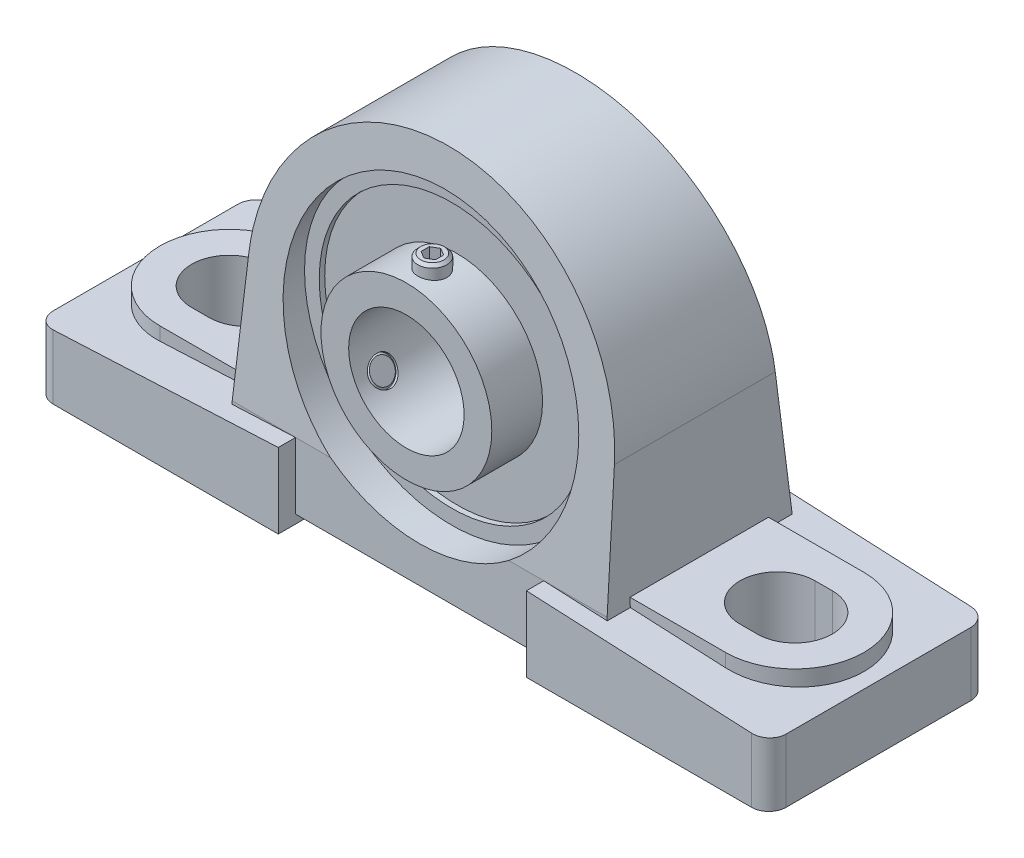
from build123d import *

# Parameters (mm, degrees)
EXTRUSION1_DEPTH             = 16
EXTRUSION1_DEPTH_BACK        = 16
EXTRUSION2_DEPTH             = 14
EXTRUSION3_DEPTH             = 14
ENL_V_MAT_EXTRU_1_DEPTH      = 127
EXTRUSION4_DEPTH             = 19
EXTRUSION4_DEPTH_BACK        = 19
EXTRUSION5_DEPTH             = 19
EXTRUSION5_DEPTH_BACK        = 19
ENL_V_MAT_EXTRU_2_DEPTH      = 15.4
ENL_V_MAT_EXTRU_2_DEPTH_BACK = 15.4
ENL_V_MAT_EXTRU_3_DEPTH      = 15.4
ENL_V_MAT_EXTRU_3_DEPTH_BACK = 15.4
ESQUISSE10_W                 = 31
ESQUISSE10_H                 = 14.8
ESQUISSE11_W                 = 33.54
ESQUISSE11_H                 = 10
ENL_V_MAT_EXTRU_4_DEPTH      = 14
ENL_V_MAT_EXTRU_4_DEPTH_BACK = 14
ESQUISSE12_W                 = 254
ESQUISSE12_H                 = 76
ESQUISSE13_W                 = 2.375
ESQUISSE13_H                 = 15
ENL_V_MAT_EXTRU_5_DEPTH      = 3.3
ENL_V_MAT_EXTRU_6_DEPTH      = 3.3


with BuildPart() as part:
    # Esquisse1 → Extrusion1 (new, two sides: drawn at the far end of the back side and taken through both)
    with BuildSketch(Plane.XY.offset(-EXTRUSION1_DEPTH_BACK)):
        with BuildLine():
            Line((15, 1.5), (80, 1.5))
            Line((80, 1.5), (80, 12.476190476))
            Line((80, 12.476190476), (79.177905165, 34.483353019))
            ThreePointArc((79.177905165, 34.483353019), (47.5, 65), (15.822094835, 34.483353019))
            Line((15.822094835, 34.483353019), (15, 12.476190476))
            Line((15, 12.476190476), (15, 1.5))
        make_face()
    extrude(amount=EXTRUSION1_DEPTH + EXTRUSION1_DEPTH_BACK)

    # Esquisse2 → Extrusion2 (add)
    with BuildSketch(Plane(origin=(0, 0, 0), x_dir=(-1, 0, 0), z_dir=(0, 1, 0))):
        with BuildLine():
            Line((1.5, 12), (-17.739130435, 12))
            Line((-17.739130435, 12), (-17.739130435, -12))
            Line((-17.739130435, -12), (1.5, -12))
            ThreePointArc((1.5, -12), (13.5, 0), (1.5, 12))
        make_face()
    extrude(amount=EXTRUSION2_DEPTH)

    # Esquisse3 → Extrusion3 (add)
    with BuildSketch(Plane(origin=(0, 0, 0), x_dir=(-1, 0, 0), z_dir=(0, 1, 0))):
        with BuildLine():
            Line((-77.260869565, -12), (-77.260869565, 12))
            Line((-77.260869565, 12), (-96.5, 12))
            ThreePointArc((-96.5, 12), (-108.5, 0), (-96.5, -12))
            Line((-96.5, -12), (-77.260869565, -12))
        make_face()
    extrude(amount=EXTRUSION3_DEPTH)

    # Esquisse4 → Enl_v. mat.-Extru.1 (cut)
    with BuildSketch(Plane(origin=(-16, 0, 0), x_dir=(0, 0, -1), z_dir=(1, 0, 0))):
        Polygon((-26.6, 0), (-16, 0), (-16, 13), (-10.6875, 68.25), (10.6875, 68.25), (16, 13), (16, 0), (26.6, 0), (26.6, 78), (-26.6, 78), align=None)
    extrude(amount=ENL_V_MAT_EXTRU_1_DEPTH, mode=Mode.SUBTRACT)

    # Esquisse5 → Extrusion4 (add, two sides: drawn at the far end of the back side and taken through both)
    with BuildSketch(Plane.XY.offset(-EXTRUSION4_DEPTH_BACK)):
        Polygon((-16, 0), (26, 0), (26, 13), (-16, 11), align=None)
    extrude(amount=EXTRUSION4_DEPTH + EXTRUSION4_DEPTH_BACK)

    # Esquisse6 → Extrusion5 (add, two sides: drawn at the far end of the back side and taken through both)
    with BuildSketch(Plane.XY.offset(-EXTRUSION5_DEPTH_BACK)):
        Polygon((69, 0), (111, 0), (111, 11), (69, 13), align=None)
    extrude(amount=EXTRUSION5_DEPTH + EXTRUSION5_DEPTH_BACK)

    # Esquisse7 → Enl_v. mat.-Extru.2 (cut, two sides: drawn at the far end of the back side and taken through both)
    with BuildSketch(Plane(origin=(0, 0, 0), x_dir=(-1, 0, 0), z_dir=(0, 1, 0)).offset(-ENL_V_MAT_EXTRU_2_DEPTH_BACK)):
        with BuildLine():
            Line((1.5, 6.5), (-1.5, 6.5))
            ThreePointArc((-1.5, 6.5), (-8, 0), (-1.5, -6.5))
            Line((-1.5, -6.5), (1.5, -6.5))
            ThreePointArc((1.5, -6.5), (8, 0), (1.5, 6.5))
        make_face()
    extrude(amount=ENL_V_MAT_EXTRU_2_DEPTH + ENL_V_MAT_EXTRU_2_DEPTH_BACK, mode=Mode.SUBTRACT)

    # Esquisse8 → Enl_v. mat.-Extru.3 (cut, two sides: drawn at the far end of the back side and taken through both)
    with BuildSketch(Plane(origin=(0, 0, 0), x_dir=(-1, 0, 0), z_dir=(0, 1, 0)).offset(-ENL_V_MAT_EXTRU_3_DEPTH_BACK)):
        with BuildLine():
            Line((-93.5, 6.5), (-96.5, 6.5))
            ThreePointArc((-96.5, 6.5), (-103, 0), (-96.5, -6.5))
            Line((-96.5, -6.5), (-93.5, -6.5))
            ThreePointArc((-93.5, -6.5), (-87, 0), (-93.5, 6.5))
        make_face()
    extrude(amount=ENL_V_MAT_EXTRU_3_DEPTH + ENL_V_MAT_EXTRU_3_DEPTH_BACK, mode=Mode.SUBTRACT)

    # Esquisse9 → Enl_vement de mati_re-R_volution1 (revolve, cut)
    with BuildSketch(Plane(origin=(47.5, 0, 0), x_dir=(0, 0, -1), z_dir=(1, 0, 0)), mode=Mode.PRIVATE) as enl_vement_de_mati_re_r_volution1_sk:
        Polygon((-16, 33.3), (-16, 58.8), (-10.45, 58.8), (-10.45, 56.25), (-9.5, 56.25), (-9.5, 35.85), (9.5, 35.85), (9.5, 56.25), (10.45, 56.25), (10.45, 58.8), (16, 58.8), (16, 33.3), align=None)
    revolve(enl_vement_de_mati_re_r_volution1_sk.sketch.rotate(Axis((47.5, 33.3, -16), (0, 0, 1)), 270), axis=Axis((47.5, 33.3, -16), (0, 0, 1)), mode=Mode.SUBTRACT)

    # Esquisse10 → R_volution1 (revolve)
    with BuildSketch(Plane(origin=(47.5, 0, 0), x_dir=(0, 0, -1), z_dir=(1, 0, 0)), mode=Mode.PRIVATE) as r_volution1_sk:
        with Locations((-2.8, 40.7)):
            Rectangle(ESQUISSE10_W, ESQUISSE10_H)
    revolve(r_volution1_sk.sketch.rotate(Axis((47.5, 33.3, -12.7), (0, 0, 1)), 270), axis=Axis((47.5, 33.3, -12.7), (0, 0, 1)))

    # Esquisse11 → Enl_vement de mati_re-R_volution2 (revolve, cut)
    with BuildSketch(Plane(origin=(47.5, 0, 0), x_dir=(0, 0, -1), z_dir=(1, 0, 0)), mode=Mode.PRIVATE) as enl_vement_de_mati_re_r_volution2_sk:
        with Locations((-2.8, 38.3)):
            Rectangle(ESQUISSE11_W, ESQUISSE11_H)
    revolve(enl_vement_de_mati_re_r_volution2_sk.sketch.rotate(Axis((47.5, 33.3, -13.97), (0, 0, 1)), 270), axis=Axis((47.5, 33.3, -13.97), (0, 0, 1)), mode=Mode.SUBTRACT)

    # Esquisse12 → Enl_v. mat.-Extru.4 (cut, two sides: drawn at the far end of the back side and taken through both)
    with BuildSketch(Plane(origin=(0, 0, 0), x_dir=(-1, 0, 0), z_dir=(0, 1, 0)).offset(-ENL_V_MAT_EXTRU_4_DEPTH_BACK)):
        with Locations((-47.5, 0)):
            Rectangle(ESQUISSE12_W, ESQUISSE12_H)
        with BuildLine():
            Line((16, -16), (16, 16))
            ThreePointArc((16, 16), (15.121320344, 18.121320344), (13, 19))
            Line((13, 19), (-108, 19))
            ThreePointArc((-108, 19), (-110.121320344, 18.121320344), (-111, 16))
            Line((-111, 16), (-111, -16))
            ThreePointArc((-111, -16), (-110.121320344, -18.121320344), (-108, -19))
            Line((-108, -19), (13, -19))
            ThreePointArc((13, -19), (15.121320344, -18.121320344), (16, -16))
        make_face(mode=Mode.SUBTRACT)
    extrude(amount=ENL_V_MAT_EXTRU_4_DEPTH + ENL_V_MAT_EXTRU_4_DEPTH_BACK, mode=Mode.SUBTRACT)

    # Esquisse13 → Enl_vement de mati_re-R_volution3 (revolve, cut)
    with BuildSketch(Plane.XY.offset(13.8), mode=Mode.PRIVATE) as enl_vement_de_mati_re_r_volution3_sk:
        with Locations((48.6875, 40.8)):
            Rectangle(ESQUISSE13_W, ESQUISSE13_H)
    revolve(enl_vement_de_mati_re_r_volution3_sk.sketch.rotate(Axis((47.5, 33.3, 13.8), (0, 1, 0)), 270), axis=Axis((47.5, 33.3, 13.8), (0, 1, 0)), mode=Mode.SUBTRACT)

    # Esquisse14 → Enl_vement de mati_re-R_volution4 (revolve, cut)
    with BuildSketch(Plane.XY.offset(13.8), mode=Mode.PRIVATE) as enl_vement_de_mati_re_r_volution4_sk:
        Polygon((34.509618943, 25.8), (33.322118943, 27.856810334), (46.3125, 35.356810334), (47.5, 33.3), align=None)
    revolve(enl_vement_de_mati_re_r_volution4_sk.sketch.rotate(Axis((47.5, 33.3, 13.8), (-0.8660254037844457, -0.49999999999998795, 0)), 180), axis=Axis((47.5, 33.3, 13.8), (-0.8660254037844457, -0.49999999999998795, 0)), mode=Mode.SUBTRACT)

    # Esquisse15 → R_volution2 (revolve)
    with BuildSketch(Plane.XY.offset(13.8), mode=Mode.PRIVATE) as r_volution2_sk:
        Polygon((47.5, 50.3), (49.5095, 50.3), (50, 49.8095), (50, 43.7905), (49.5095, 43.3), (47.5, 43.3), align=None)
    revolve(r_volution2_sk.sketch.rotate(Axis((47.5, 43.3, 13.8), (0, 1, 0)), 270), axis=Axis((47.5, 43.3, 13.8), (0, 1, 0)))

    # Esquisse16 → R_volution3 (revolve)
    with BuildSketch(Plane.XY.offset(13.8), mode=Mode.PRIVATE) as r_volution3_sk:
        Polygon((32.777568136, 24.8), (31.772818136, 26.540278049), (31.952353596, 27.210313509), (37.164960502, 30.219813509), (37.834995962, 30.040278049), (38.839745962, 28.3), align=None)
    revolve(r_volution3_sk.sketch.rotate(Axis((38.839745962, 28.3, 13.8), (-0.8660254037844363, -0.5000000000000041, 0)), 180), axis=Axis((38.839745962, 28.3, 13.8), (-0.8660254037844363, -0.5000000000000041, 0)))

    # Esquisse17 → Enl_v. mat.-Extru.5 (cut)
    with BuildSketch(Plane(origin=(0, 50.3, 0), x_dir=(-1, 0, 0), z_dir=(0, 1, 0))):
        Polygon((-46.25, 13.078312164), (-46.25, 14.521687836), (-47.5, 15.243375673), (-48.75, 14.521687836), (-48.75, 13.078312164), (-47.5, 12.356624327), align=None)
    extrude(amount=-ENL_V_MAT_EXTRU_5_DEPTH, mode=Mode.SUBTRACT)

    # Esquisse18 → Enl_v. mat.-Extru.6 (cut)
    with BuildSketch(Plane(origin=(35.321891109, 20.39310334, 0), x_dir=(0, 0, -1), z_dir=(0.8660254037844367, 0.5000000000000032, 0))):
        Polygon((-15.243375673, 5.088645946), (-14.521687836, 3.838645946), (-13.078312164, 3.838645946), (-12.356624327, 5.088645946), (-13.078312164, 6.338645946), (-14.521687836, 6.338645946), align=None)
    extrude(amount=ENL_V_MAT_EXTRU_6_DEPTH, mode=Mode.SUBTRACT)


solid = part.part
